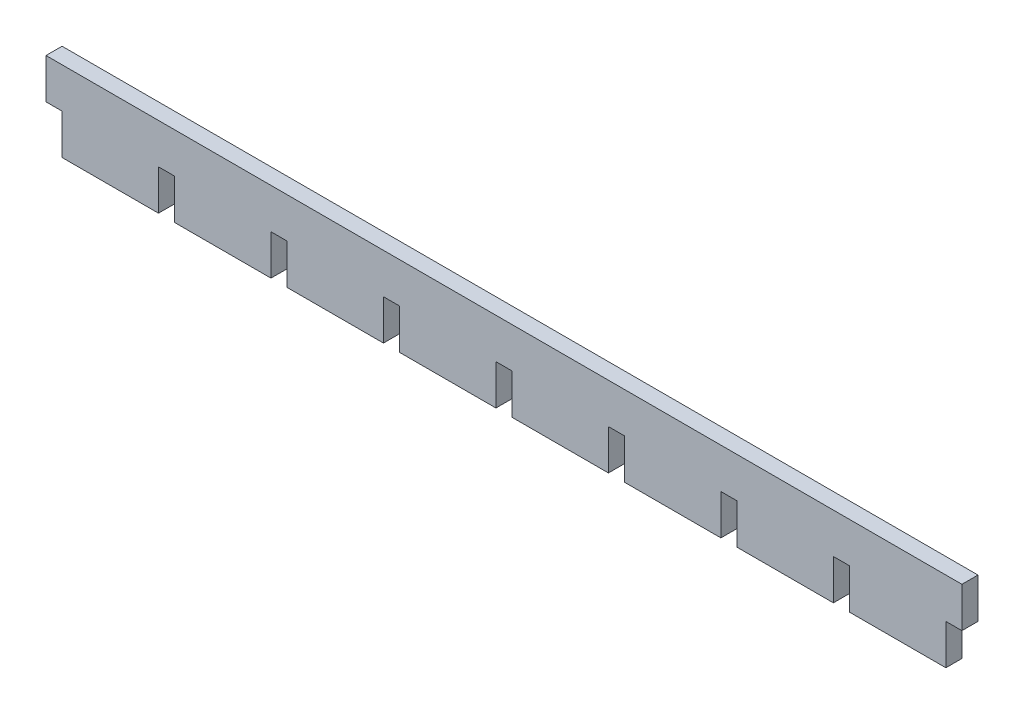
from build123d import *

# Parameters (mm, degrees)
BOSS_EXTRUDE1_DEPTH = 6


with BuildPart() as part:
    # Sketch1 → Boss-Extrude1 (new body)
    with BuildSketch(Plane.XY):
        Polygon((6, 15), (6, 0), (42, 0), (42, 15), (48, 15), (48, 0), (84, 0), (84, 15), (90, 15), (90, 0), (126, 0), (126, 15), (132, 15), (132, 0), (168, 0), (168, 15), (174, 15), (174, 0), (210, 0), (210, 15), (216, 15), (216, 0), (252, 0), (252, 15), (258, 15), (258, 0), (294, 0), (294, 15), (300, 15), (300, 0), (336, 0), (336, 15), (342, 15), (342, 30), (0, 30), (0, 15), align=None)
    extrude(amount=BOSS_EXTRUDE1_DEPTH)


solid = part.part
